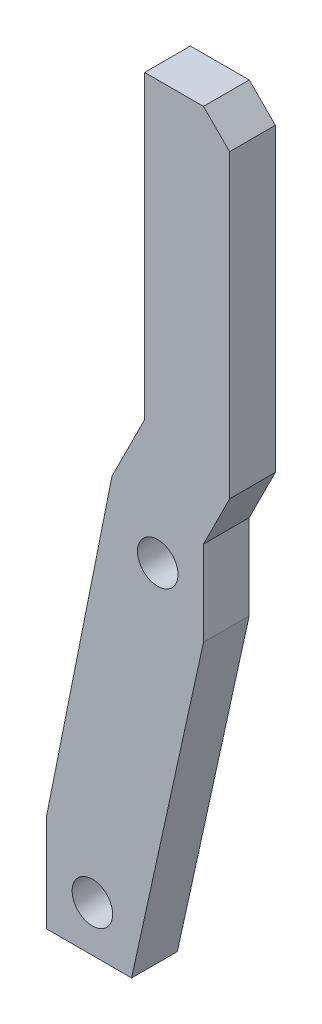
from build123d import *

# Parameters (mm, degrees)
PARALLEL_FINGER_DEPTH     = 3.5
SKETCH_2_R                = 3.1
FINGER_PIVOTS_10X50_DEPTH = 250


with BuildPart() as part:
    # Sketch 1 → Parallel_Finger (new, symmetric)
    with BuildSketch(Plane.XY):
        Polygon((-7, -7), (6, -7), (17, 43), (17, 56), (21, 64), (21, 110), (17, 114), (8, 114), (8, 68), (3, 58), (-7, 8), align=None)
    extrude(amount=PARALLEL_FINGER_DEPTH, both=True)

    # Sketch 2 → Finger_Pivots_10x50 (cut, symmetric)
    with BuildSketch(Plane.XY):
        Circle(SKETCH_2_R)
        with Locations((10, 50)):
            Circle(SKETCH_2_R)
    extrude(amount=FINGER_PIVOTS_10X50_DEPTH, both=True, mode=Mode.SUBTRACT)


solid = part.part
